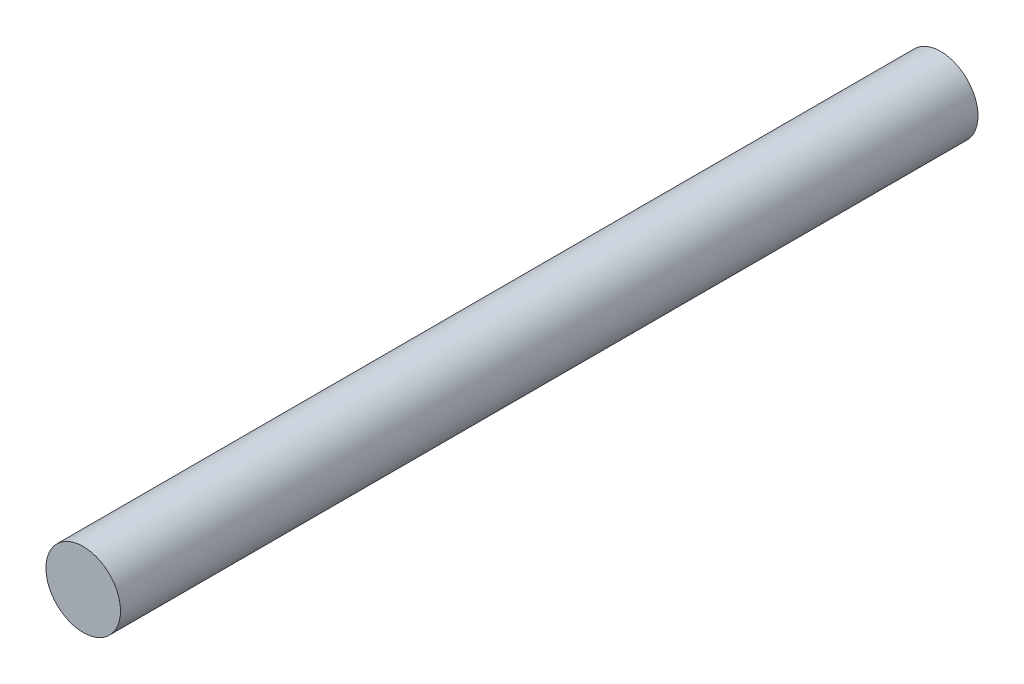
from build123d import *

# Parameters (mm, degrees)
SKETCH2_R          = 50.8
BASE_EXTRUDE_DEPTH = 1168.4


with BuildPart() as part:
    # Sketch2 → Base-Extrude (new body)
    with BuildSketch(Plane.XY):
        Circle(SKETCH2_R)
    extrude(amount=-BASE_EXTRUDE_DEPTH)


solid = part.part
